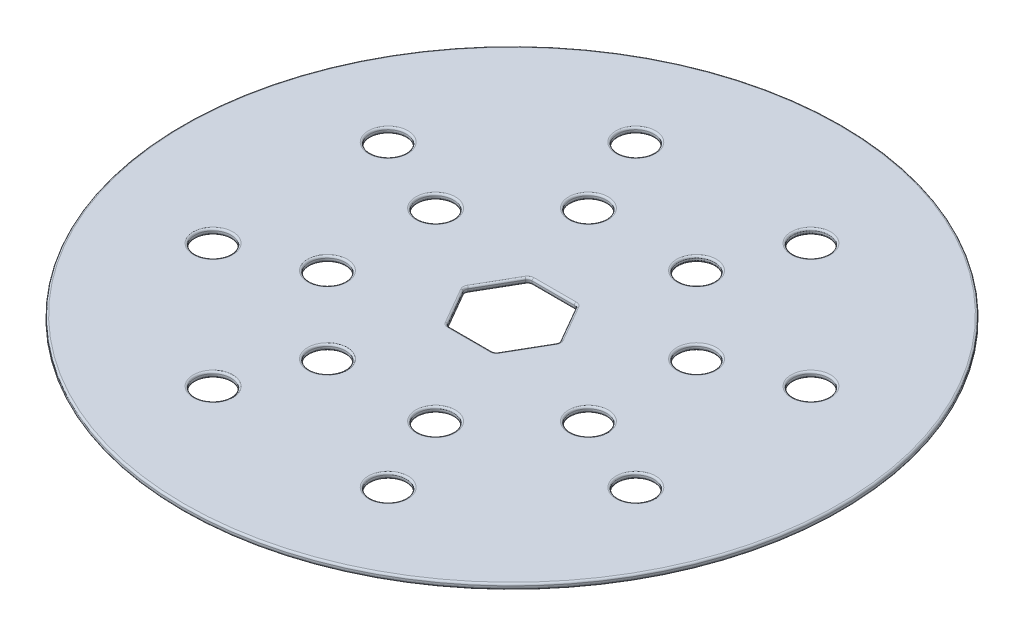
from build123d import *
from OCP.BRepFilletAPI import BRepFilletAPI_MakeFillet

# Parameters (mm, degrees)
SKETCH1_R          = 44.45
EXTRUDE1_DEPTH     = 0.762
SKETCH2_R          = 2.413
CUT_EXTRUDE1_DEPTH = 63.866411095
CIRPATTERN1_COUNT  = 8
FILLET1_R1         = 0.254
FILLET1_R2         = 0.635


with BuildPart() as part:
    # Sketch1 → Extrude1 (new body)
    with BuildSketch(Plane(origin=(0, 0, 0), x_dir=(1, 0, 0), z_dir=(0, 1, 0))):
        with Locations(Location((0, 0, 0), (0, 0, 90))):
            Circle(SKETCH1_R)
        Polygon((-6.423137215, 0), (-3.211568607, -5.5626), (3.211568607, -5.5626), (6.423137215, 0), (3.211568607, 5.5626), (-3.211568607, 5.5626), align=None, mode=Mode.SUBTRACT)
    extrude(amount=EXTRUDE1_DEPTH)

    # Sketch2 → Cut-Extrude1 (cut, through all)
    with BuildSketch(Plane(origin=(0, 0.762, 0), x_dir=(-1, 0, 0), z_dir=(0, 1, 0))):
        with Locations(Location((28.511846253, -11.809993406, 0), (0, 0, 90))):
            Circle(SKETCH2_R)
        with Locations(Location((17.599905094, -7.290119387, 0), (0, 0, 90))):
            Circle(SKETCH2_R)
    cut_extrude1 = extrude(amount=-CUT_EXTRUDE1_DEPTH, mode=Mode.SUBTRACT)

    # CirPattern1: Cut-Extrude1 ×8 about axis
    cirpattern1_axis = Axis((0, 0, 0), (0, 1, 0))
    for i in range(1, CIRPATTERN1_COUNT):
        add(cut_extrude1.rotate(cirpattern1_axis, i * 360 / CIRPATTERN1_COUNT), mode=Mode.SUBTRACT)

    # Fillet1: one fillet with a radius per group of edges: ONE call of the kernel's fillet builder (fillet() takes one radius for all edges)
    fillet1_edges_1 = [part.edges().sort_by_distance(p)[0] for p in [
        (0, 0, 5.5626),
        (4.817352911, 0, 2.7813),
        (4.817352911, 0, -2.7813),
        (0, 0, -5.5626),
        (-4.817352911, 0.762, -2.7813),
        (-4.817352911, 0.762, 2.7813),
        (0, 0.762, 5.5626),
        (4.817352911, 0.762, 2.7813),
        (4.817352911, 0.762, -2.7813),
        (0, 0.762, -5.5626),
        (0, 0, 44.45),
        (-28.511846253, 0, -14.222993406),
        (-28.511846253, 0.762, -14.222993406),
        (-17.599905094, 0, -9.703119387),
        (-17.599905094, 0.762, -9.703119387),
        (-5.583870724, 0.762, -19.306153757),
        (-5.583870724, 0, -19.306153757),
        (9.703119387, 0.762, -17.599905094),
        (9.703119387, 0, -17.599905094),
        (0, 0.762, 44.45),
        (19.306153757, 0.762, -5.583870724),
        (19.306153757, 0, -5.583870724),
        (17.599905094, 0.762, 9.703119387),
        (17.599905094, 0, 9.703119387),
        (5.583870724, 0.762, 19.306153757),
        (5.583870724, 0, 19.306153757),
        (-9.703119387, 0.762, 17.599905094),
        (-9.703119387, 0, 17.599905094),
        (-19.306153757, 0.762, 5.583870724),
        (-19.306153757, 0, 5.583870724),
        (-10.103744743, 0.762, -30.218094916),
        (-10.103744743, 0, -30.218094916),
        (14.222993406, 0.762, -28.511846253),
        (14.222993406, 0, -28.511846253),
        (30.218094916, 0.762, -10.103744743),
        (30.218094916, 0, -10.103744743),
        (28.511846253, 0.762, 14.222993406),
        (28.511846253, 0, 14.222993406),
        (10.103744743, 0.762, 30.218094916),
        (10.103744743, 0, 30.218094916),
        (-14.222993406, 0.762, 28.511846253),
        (-14.222993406, 0, 28.511846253),
        (-30.218094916, 0.762, 10.103744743),
        (-30.218094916, 0, 10.103744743),
        (-4.817352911, 0, -2.7813),
        (-4.817352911, 0, 2.7813),
    ]]
    fillet1_edges_2 = [part.edges().sort_by_distance(p)[0] for p in [
        (-6.423137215, 0.381, 0),
        (-3.211568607, 0.381, 5.5626),
        (3.211568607, 0.381, 5.5626),
        (6.423137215, 0.381, 0),
        (3.211568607, 0.381, -5.5626),
        (-3.211568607, 0.381, -5.5626),
    ]]
    fillet1 = BRepFilletAPI_MakeFillet(part.part.solid().wrapped)
    for e in fillet1_edges_1:
        fillet1.Add(FILLET1_R1, e.wrapped)
    for e in fillet1_edges_2:
        fillet1.Add(FILLET1_R2, e.wrapped)
    add(Compound.cast(fillet1.Shape()), mode=Mode.REPLACE)


solid = part.part
